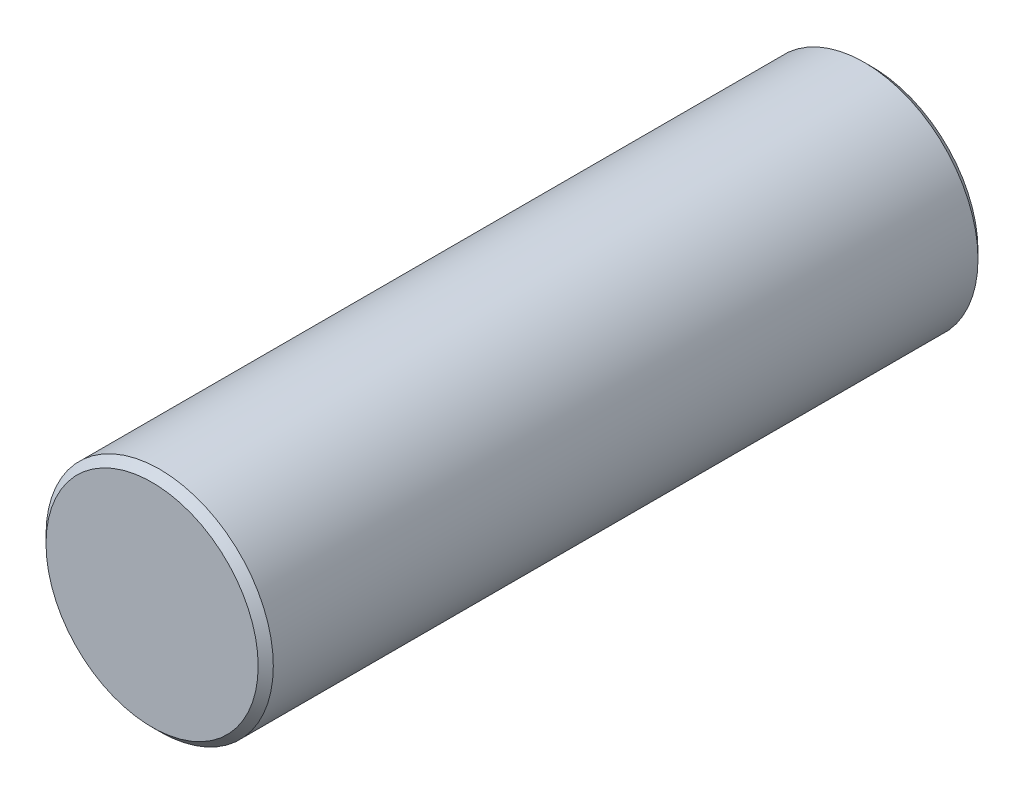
from build123d import *

# Parameters (mm, degrees)
ESQUISSE1_R            = 1.5
CYLINDRE_DE_BASE_DEPTH = 4.75
CHANFREINS_SIZE        = 0.1


with BuildPart() as part:
    # Esquisse1 → Cylindre de base (new, symmetric)
    with BuildSketch(Plane.XY):
        with Locations(Location((0, 0, 0), (0, 0, 180))):
            Circle(ESQUISSE1_R)
    extrude(amount=CYLINDRE_DE_BASE_DEPTH, both=True)

    # Chanfreins
    chanfreins_edges = [part.edges().sort_by_distance(p)[0] for p in [
        (1.5, 0, -4.75),
        (1.5, 0, 4.75),
    ]]
    chamfer(chanfreins_edges, length=CHANFREINS_SIZE)


solid = part.part
